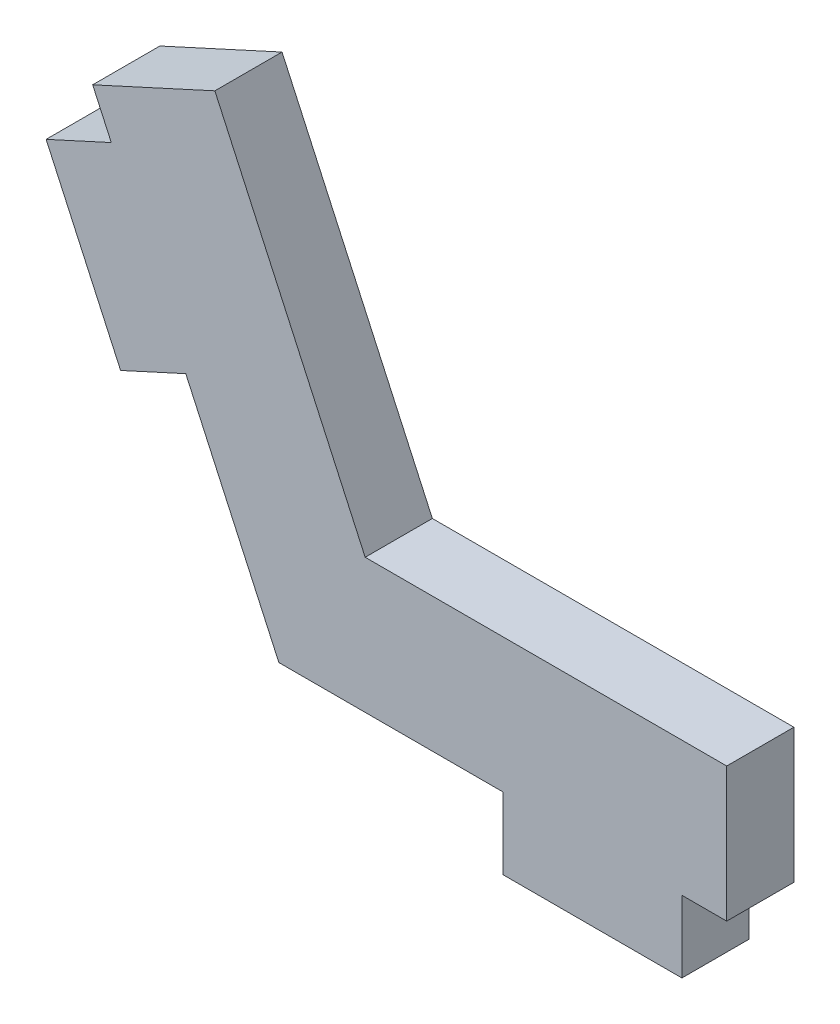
ISO-10303-21;
HEADER;
FILE_DESCRIPTION(('STEP AP214'),'2;1');
FILE_NAME('part.step','',(''),(''),'','','');
FILE_SCHEMA(('AUTOMOTIVE_DESIGN { 1 0 10303 214 1 1 1 1 }'));
ENDSEC;
DATA;
#1=APPLICATION_CONTEXT('core data for automotive mechanical design processes');
#2=APPLICATION_PROTOCOL_DEFINITION('international standard','automotive_design',2000,#1);
#3=PRODUCT_CONTEXT('',#1,'mechanical');
#4=PRODUCT('Part','Part','',(#3));
#5=PRODUCT_RELATED_PRODUCT_CATEGORY('part','',(#4));
#6=PRODUCT_DEFINITION_FORMATION('','',#4);
#7=PRODUCT_DEFINITION_CONTEXT('part definition',#1,'design');
#8=PRODUCT_DEFINITION('design','',#6,#7);
#9=PRODUCT_DEFINITION_SHAPE('','',#8);
#10=(LENGTH_UNIT() NAMED_UNIT(*) SI_UNIT(.MILLI.,.METRE.));
#11=(NAMED_UNIT(*) PLANE_ANGLE_UNIT() SI_UNIT($,.RADIAN.));
#12=(NAMED_UNIT(*) SI_UNIT($,.STERADIAN.) SOLID_ANGLE_UNIT());
#13=UNCERTAINTY_MEASURE_WITH_UNIT(LENGTH_MEASURE(1.E-05),#10,'distance_accuracy_value','');
#14=(GEOMETRIC_REPRESENTATION_CONTEXT(3) GLOBAL_UNCERTAINTY_ASSIGNED_CONTEXT((#13)) GLOBAL_UNIT_ASSIGNED_CONTEXT((#10,
#11,#12)) REPRESENTATION_CONTEXT('',''));
#15=CARTESIAN_POINT('',(0.,0.,0.));
#16=DIRECTION('',(0.,0.,1.));
#17=DIRECTION('',(1.,0.,0.));
#18=AXIS2_PLACEMENT_3D('',#15,#16,#17);
#19=CARTESIAN_POINT('',(0.,0.,3.));
#20=DIRECTION('',(0.,1.,0.));
#21=DIRECTION('',(0.,0.,1.));
#22=AXIS2_PLACEMENT_3D('',#19,#20,#21);
#23=PLANE('',#22);
#24=DIRECTION('',(0.,0.,-1.));
#25=VECTOR('',#24,1.);
#26=CARTESIAN_POINT('',(10.,0.,3.));
#27=LINE('',#26,#25);
#28=CARTESIAN_POINT('',(10.,0.,3.));
#29=VERTEX_POINT('',#28);
#30=CARTESIAN_POINT('',(10.,0.,0.));
#31=VERTEX_POINT('',#30);
#32=EDGE_CURVE('E142',#29,#31,#27,.T.);
#33=ORIENTED_EDGE('',*,*,#32,.F.);
#34=DIRECTION('',(1.,0.,0.));
#35=VECTOR('',#34,1.);
#36=CARTESIAN_POINT('',(0.,0.,3.));
#37=LINE('',#36,#35);
#38=CARTESIAN_POINT('',(0.,0.,3.));
#39=VERTEX_POINT('',#38);
#40=EDGE_CURVE('E159',#39,#29,#37,.T.);
#41=ORIENTED_EDGE('',*,*,#40,.F.);
#42=DIRECTION('',(0.,0.,-1.));
#43=VECTOR('',#42,1.);
#44=CARTESIAN_POINT('',(0.,0.,3.));
#45=LINE('',#44,#43);
#46=CARTESIAN_POINT('',(0.,0.,0.));
#47=VERTEX_POINT('',#46);
#48=EDGE_CURVE('E191',#39,#47,#45,.T.);
#49=ORIENTED_EDGE('',*,*,#48,.T.);
#50=DIRECTION('',(1.,0.,0.));
#51=VECTOR('',#50,1.);
#52=CARTESIAN_POINT('',(0.,0.,0.));
#53=LINE('',#52,#51);
#54=EDGE_CURVE('E186',#47,#31,#53,.T.);
#55=ORIENTED_EDGE('',*,*,#54,.T.);
#56=EDGE_LOOP('',(#33,#41,#49,#55));
#57=FACE_BOUND('',#56,.T.);
#58=ADVANCED_FACE('F37',(#57),#23,.F.);
#59=CARTESIAN_POINT('',(0.,0.,3.));
#60=DIRECTION('',(-0.909453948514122,-0.415804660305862,0.));
#61=DIRECTION('',(0.415804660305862,-0.909453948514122,0.));
#62=AXIS2_PLACEMENT_3D('',#59,#60,#61);
#63=PLANE('',#62);
#64=DIRECTION('',(-0.415804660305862,0.909453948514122,0.));
#65=VECTOR('',#64,1.);
#66=CARTESIAN_POINT('',(0.,0.,0.));
#67=LINE('',#66,#65);
#68=CARTESIAN_POINT('',(-7.48448388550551,16.3701710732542,0.));
#69=VERTEX_POINT('',#68);
#70=CARTESIAN_POINT('',(-8.31609320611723,18.1890789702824,0.));
#71=VERTEX_POINT('',#70);
#72=EDGE_CURVE('E181',#69,#71,#67,.T.);
#73=ORIENTED_EDGE('',*,*,#72,.F.);
#74=DIRECTION('',(0.,0.,-1.));
#75=VECTOR('',#74,1.);
#76=CARTESIAN_POINT('',(-7.48448388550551,16.3701710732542,3.));
#77=LINE('',#76,#75);
#78=CARTESIAN_POINT('',(-7.48448388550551,16.3701710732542,3.));
#79=VERTEX_POINT('',#78);
#80=EDGE_CURVE('E231',#79,#69,#77,.T.);
#81=ORIENTED_EDGE('',*,*,#80,.F.);
#82=DIRECTION('',(-0.415804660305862,0.909453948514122,0.));
#83=VECTOR('',#82,1.);
#84=CARTESIAN_POINT('',(0.,0.,3.));
#85=LINE('',#84,#83);
#86=CARTESIAN_POINT('',(-8.31609320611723,18.1890789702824,3.));
#87=VERTEX_POINT('',#86);
#88=EDGE_CURVE('E164',#79,#87,#85,.T.);
#89=ORIENTED_EDGE('',*,*,#88,.T.);
#90=DIRECTION('',(0.,0.,-1.));
#91=VECTOR('',#90,1.);
#92=CARTESIAN_POINT('',(-8.31609320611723,18.1890789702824,3.));
#93=LINE('',#92,#91);
#94=EDGE_CURVE('E193',#87,#71,#93,.T.);
#95=ORIENTED_EDGE('',*,*,#94,.T.);
#96=EDGE_LOOP('',(#73,#81,#89,#95));
#97=FACE_BOUND('',#96,.T.);
#98=ADVANCED_FACE('F272',(#97),#63,.T.);
#99=CARTESIAN_POINT('',(20.,0.,3.));
#100=DIRECTION('',(1.,0.,0.));
#101=DIRECTION('',(0.,0.,-1.));
#102=AXIS2_PLACEMENT_3D('',#99,#100,#101);
#103=PLANE('',#102);
#104=DIRECTION('',(0.,-1.,0.));
#105=VECTOR('',#104,1.);
#106=CARTESIAN_POINT('',(20.,0.,0.));
#107=LINE('',#106,#105);
#108=CARTESIAN_POINT('',(20.,6.,0.));
#109=VERTEX_POINT('',#108);
#110=CARTESIAN_POINT('',(20.,0.,0.));
#111=VERTEX_POINT('',#110);
#112=EDGE_CURVE('E168',#109,#111,#107,.T.);
#113=ORIENTED_EDGE('',*,*,#112,.F.);
#114=DIRECTION('',(0.,0.,-1.));
#115=VECTOR('',#114,1.);
#116=CARTESIAN_POINT('',(20.,6.,3.));
#117=LINE('',#116,#115);
#118=CARTESIAN_POINT('',(20.,6.,3.));
#119=VERTEX_POINT('',#118);
#120=EDGE_CURVE('E11',#119,#109,#117,.T.);
#121=ORIENTED_EDGE('',*,*,#120,.F.);
#122=DIRECTION('',(0.,-1.,0.));
#123=VECTOR('',#122,1.);
#124=CARTESIAN_POINT('',(20.,0.,3.));
#125=LINE('',#124,#123);
#126=CARTESIAN_POINT('',(20.,0.,3.));
#127=VERTEX_POINT('',#126);
#128=EDGE_CURVE('E189',#119,#127,#125,.T.);
#129=ORIENTED_EDGE('',*,*,#128,.T.);
#130=DIRECTION('',(0.,0.,-1.));
#131=VECTOR('',#130,1.);
#132=CARTESIAN_POINT('',(20.,0.,3.));
#133=LINE('',#132,#131);
#134=EDGE_CURVE('E157',#127,#111,#133,.T.);
#135=ORIENTED_EDGE('',*,*,#134,.T.);
#136=EDGE_LOOP('',(#113,#121,#129,#135));
#137=FACE_BOUND('',#136,.T.);
#138=ADVANCED_FACE('F39',(#137),#103,.T.);
#139=CARTESIAN_POINT('',(0.,6.,3.));
#140=DIRECTION('',(0.,1.,0.));
#141=DIRECTION('',(0.,0.,1.));
#142=AXIS2_PLACEMENT_3D('',#139,#140,#141);
#143=PLANE('',#142);
#144=DIRECTION('',(1.,0.,0.));
#145=VECTOR('',#144,1.);
#146=CARTESIAN_POINT('',(0.,6.,0.));
#147=LINE('',#146,#145);
#148=CARTESIAN_POINT('',(3.85415011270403,6.,0.));
#149=VERTEX_POINT('',#148);
#150=EDGE_CURVE('E171',#149,#109,#147,.T.);
#151=ORIENTED_EDGE('',*,*,#150,.F.);
#152=DIRECTION('',(0.,0.,-1.));
#153=VECTOR('',#152,1.);
#154=CARTESIAN_POINT('',(3.85415011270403,6.,3.));
#155=LINE('',#154,#153);
#156=CARTESIAN_POINT('',(3.85415011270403,6.,3.));
#157=VERTEX_POINT('',#156);
#158=EDGE_CURVE('E45',#157,#149,#155,.T.);
#159=ORIENTED_EDGE('',*,*,#158,.F.);
#160=DIRECTION('',(1.,0.,0.));
#161=VECTOR('',#160,1.);
#162=CARTESIAN_POINT('',(0.,6.,3.));
#163=LINE('',#162,#161);
#164=EDGE_CURVE('E219',#157,#119,#163,.T.);
#165=ORIENTED_EDGE('',*,*,#164,.T.);
#166=ORIENTED_EDGE('',*,*,#120,.T.);
#167=EDGE_LOOP('',(#151,#159,#165,#166));
#168=FACE_BOUND('',#167,.T.);
#169=ADVANCED_FACE('F207',(#168),#143,.T.);
#170=CARTESIAN_POINT('',(5.45672369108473,2.49482796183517,3.));
#171=DIRECTION('',(0.909453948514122,0.415804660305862,0.));
#172=DIRECTION('',(-0.415804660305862,0.909453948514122,0.));
#173=AXIS2_PLACEMENT_3D('',#170,#171,#172);
#174=PLANE('',#173);
#175=DIRECTION('',(0.415804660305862,-0.909453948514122,0.));
#176=VECTOR('',#175,1.);
#177=CARTESIAN_POINT('',(5.45672369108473,2.49482796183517,0.));
#178=LINE('',#177,#176);
#179=CARTESIAN_POINT('',(-2.8593695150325,20.6839069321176,0.));
#180=VERTEX_POINT('',#179);
#181=EDGE_CURVE('E175',#180,#149,#178,.T.);
#182=ORIENTED_EDGE('',*,*,#181,.F.);
#183=DIRECTION('',(0.,0.,-1.));
#184=VECTOR('',#183,1.);
#185=CARTESIAN_POINT('',(-2.8593695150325,20.6839069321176,3.));
#186=LINE('',#185,#184);
#187=CARTESIAN_POINT('',(-2.8593695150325,20.6839069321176,3.));
#188=VERTEX_POINT('',#187);
#189=EDGE_CURVE('E196',#188,#180,#186,.T.);
#190=ORIENTED_EDGE('',*,*,#189,.F.);
#191=DIRECTION('',(0.415804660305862,-0.909453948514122,0.));
#192=VECTOR('',#191,1.);
#193=CARTESIAN_POINT('',(5.45672369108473,2.49482796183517,3.));
#194=LINE('',#193,#192);
#195=EDGE_CURVE('E203',#188,#157,#194,.T.);
#196=ORIENTED_EDGE('',*,*,#195,.T.);
#197=ORIENTED_EDGE('',*,*,#158,.T.);
#198=EDGE_LOOP('',(#182,#190,#196,#197));
#199=FACE_BOUND('',#198,.T.);
#200=ADVANCED_FACE('F201',(#199),#174,.T.);
#201=CARTESIAN_POINT('',(-8.31609320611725,18.1890789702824,3.));
#202=DIRECTION('',(-0.415804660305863,0.909453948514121,0.));
#203=DIRECTION('',(-0.909453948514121,-0.415804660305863,0.));
#204=AXIS2_PLACEMENT_3D('',#201,#202,#203);
#205=PLANE('',#204);
#206=DIRECTION('',(0.909453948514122,0.415804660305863,0.));
#207=VECTOR('',#206,1.);
#208=CARTESIAN_POINT('',(-8.31609320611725,18.1890789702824,0.));
#209=LINE('',#208,#207);
#210=EDGE_CURVE('E178',#71,#180,#209,.T.);
#211=ORIENTED_EDGE('',*,*,#210,.F.);
#212=ORIENTED_EDGE('',*,*,#94,.F.);
#213=DIRECTION('',(0.909453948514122,0.415804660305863,0.));
#214=VECTOR('',#213,1.);
#215=CARTESIAN_POINT('',(-8.31609320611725,18.1890789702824,3.));
#216=LINE('',#215,#214);
#217=EDGE_CURVE('E217',#87,#188,#216,.T.);
#218=ORIENTED_EDGE('',*,*,#217,.T.);
#219=ORIENTED_EDGE('',*,*,#189,.T.);
#220=EDGE_LOOP('',(#211,#212,#218,#219));
#221=FACE_BOUND('',#220,.T.);
#222=ADVANCED_FACE('F214',(#221),#205,.T.);
#223=DIRECTION('',(0.,0.,-1.));
#224=VECTOR('',#223,1.);
#225=CARTESIAN_POINT('',(-4.15804660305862,9.09453948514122,3.));
#226=LINE('',#225,#224);
#227=CARTESIAN_POINT('',(-4.15804660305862,9.09453948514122,3.));
#228=VERTEX_POINT('',#227);
#229=CARTESIAN_POINT('',(-4.15804660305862,9.09453948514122,0.));
#230=VERTEX_POINT('',#229);
#231=EDGE_CURVE('E228',#228,#230,#226,.T.);
#232=ORIENTED_EDGE('',*,*,#231,.T.);
#233=EDGE_CURVE('E182',#47,#230,#67,.T.);
#234=ORIENTED_EDGE('',*,*,#233,.F.);
#235=ORIENTED_EDGE('',*,*,#48,.F.);
#236=EDGE_CURVE('E160',#39,#228,#85,.T.);
#237=ORIENTED_EDGE('',*,*,#236,.T.);
#238=EDGE_LOOP('',(#232,#234,#235,#237));
#239=FACE_BOUND('',#238,.T.);
#240=ADVANCED_FACE('F279',(#239),#63,.T.);
#241=CARTESIAN_POINT('',(18.,0.,3.));
#242=VERTEX_POINT('',#241);
#243=EDGE_CURVE('E147',#242,#127,#37,.T.);
#244=ORIENTED_EDGE('',*,*,#243,.F.);
#245=DIRECTION('',(0.,0.,-1.));
#246=VECTOR('',#245,1.);
#247=CARTESIAN_POINT('',(18.,0.,3.));
#248=LINE('',#247,#246);
#249=CARTESIAN_POINT('',(18.,0.,0.));
#250=VERTEX_POINT('',#249);
#251=EDGE_CURVE('E135',#242,#250,#248,.T.);
#252=ORIENTED_EDGE('',*,*,#251,.T.);
#253=EDGE_CURVE('E185',#250,#111,#53,.T.);
#254=ORIENTED_EDGE('',*,*,#253,.T.);
#255=ORIENTED_EDGE('',*,*,#134,.F.);
#256=EDGE_LOOP('',(#244,#252,#254,#255));
#257=FACE_BOUND('',#256,.T.);
#258=ADVANCED_FACE('F155',(#257),#23,.F.);
#259=CARTESIAN_POINT('',(0.,0.,3.));
#260=DIRECTION('',(0.,0.,1.));
#261=DIRECTION('',(1.,0.,0.));
#262=AXIS2_PLACEMENT_3D('',#259,#260,#261);
#263=PLANE('',#262);
#264=ORIENTED_EDGE('',*,*,#128,.F.);
#265=ORIENTED_EDGE('',*,*,#164,.F.);
#266=ORIENTED_EDGE('',*,*,#195,.F.);
#267=ORIENTED_EDGE('',*,*,#217,.F.);
#268=ORIENTED_EDGE('',*,*,#88,.F.);
#269=DIRECTION('',(-0.909453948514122,-0.415804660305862,0.));
#270=VECTOR('',#269,1.);
#271=CARTESIAN_POINT('',(-7.48448388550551,16.3701710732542,3.));
#272=LINE('',#271,#270);
#273=CARTESIAN_POINT('',(-10.3947365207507,15.0395961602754,3.));
#274=VERTEX_POINT('',#273);
#275=EDGE_CURVE('E237',#79,#274,#272,.T.);
#276=ORIENTED_EDGE('',*,*,#275,.T.);
#277=DIRECTION('',(0.415804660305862,-0.909453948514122,0.));
#278=VECTOR('',#277,1.);
#279=CARTESIAN_POINT('',(-2.91025263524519,-1.33057491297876,3.));
#280=LINE('',#279,#278);
#281=CARTESIAN_POINT('',(-7.06829923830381,7.76396457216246,3.));
#282=VERTEX_POINT('',#281);
#283=EDGE_CURVE('E244',#274,#282,#280,.T.);
#284=ORIENTED_EDGE('',*,*,#283,.T.);
#285=DIRECTION('',(-0.909453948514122,-0.415804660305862,0.));
#286=VECTOR('',#285,1.);
#287=CARTESIAN_POINT('',(-4.15804660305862,9.09453948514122,3.));
#288=LINE('',#287,#286);
#289=EDGE_CURVE('E233',#228,#282,#288,.T.);
#290=ORIENTED_EDGE('',*,*,#289,.F.);
#291=ORIENTED_EDGE('',*,*,#236,.F.);
#292=ORIENTED_EDGE('',*,*,#40,.T.);
#293=DIRECTION('',(0.,-1.,0.));
#294=VECTOR('',#293,1.);
#295=CARTESIAN_POINT('',(10.,0.,3.));
#296=LINE('',#295,#294);
#297=CARTESIAN_POINT('',(10.,-3.2,3.));
#298=VERTEX_POINT('',#297);
#299=EDGE_CURVE('E152',#29,#298,#296,.T.);
#300=ORIENTED_EDGE('',*,*,#299,.T.);
#301=DIRECTION('',(1.,0.,0.));
#302=VECTOR('',#301,1.);
#303=CARTESIAN_POINT('',(0.,-3.2,3.));
#304=LINE('',#303,#302);
#305=CARTESIAN_POINT('',(18.,-3.2,3.));
#306=VERTEX_POINT('',#305);
#307=EDGE_CURVE('E150',#298,#306,#304,.T.);
#308=ORIENTED_EDGE('',*,*,#307,.T.);
#309=DIRECTION('',(0.,-1.,0.));
#310=VECTOR('',#309,1.);
#311=CARTESIAN_POINT('',(18.,0.,3.));
#312=LINE('',#311,#310);
#313=EDGE_CURVE('E138',#242,#306,#312,.T.);
#314=ORIENTED_EDGE('',*,*,#313,.F.);
#315=ORIENTED_EDGE('',*,*,#243,.T.);
#316=EDGE_LOOP('',(#264,#265,#266,#267,#268,#276,#284,#290,#291,#292,#300,#308,#314,#315));
#317=FACE_BOUND('',#316,.T.);
#318=ADVANCED_FACE('F146',(#317),#263,.T.);
#319=CARTESIAN_POINT('',(0.,0.,0.));
#320=DIRECTION('',(0.,0.,1.));
#321=DIRECTION('',(1.,0.,0.));
#322=AXIS2_PLACEMENT_3D('',#319,#320,#321);
#323=PLANE('',#322);
#324=ORIENTED_EDGE('',*,*,#112,.T.);
#325=ORIENTED_EDGE('',*,*,#253,.F.);
#326=DIRECTION('',(0.,-1.,0.));
#327=VECTOR('',#326,1.);
#328=CARTESIAN_POINT('',(18.,0.,0.));
#329=LINE('',#328,#327);
#330=CARTESIAN_POINT('',(18.,-3.2,0.));
#331=VERTEX_POINT('',#330);
#332=EDGE_CURVE('E52',#250,#331,#329,.T.);
#333=ORIENTED_EDGE('',*,*,#332,.T.);
#334=DIRECTION('',(1.,0.,0.));
#335=VECTOR('',#334,1.);
#336=CARTESIAN_POINT('',(0.,-3.2,0.));
#337=LINE('',#336,#335);
#338=CARTESIAN_POINT('',(10.,-3.2,0.));
#339=VERTEX_POINT('',#338);
#340=EDGE_CURVE('E153',#339,#331,#337,.T.);
#341=ORIENTED_EDGE('',*,*,#340,.F.);
#342=DIRECTION('',(0.,-1.,0.));
#343=VECTOR('',#342,1.);
#344=CARTESIAN_POINT('',(10.,0.,0.));
#345=LINE('',#344,#343);
#346=EDGE_CURVE('E256',#31,#339,#345,.T.);
#347=ORIENTED_EDGE('',*,*,#346,.F.);
#348=ORIENTED_EDGE('',*,*,#54,.F.);
#349=ORIENTED_EDGE('',*,*,#233,.T.);
#350=DIRECTION('',(-0.909453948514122,-0.415804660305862,0.));
#351=VECTOR('',#350,1.);
#352=CARTESIAN_POINT('',(-4.15804660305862,9.09453948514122,0.));
#353=LINE('',#352,#351);
#354=CARTESIAN_POINT('',(-7.06829923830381,7.76396457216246,0.));
#355=VERTEX_POINT('',#354);
#356=EDGE_CURVE('E234',#230,#355,#353,.T.);
#357=ORIENTED_EDGE('',*,*,#356,.T.);
#358=DIRECTION('',(0.415804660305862,-0.909453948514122,0.));
#359=VECTOR('',#358,1.);
#360=CARTESIAN_POINT('',(-2.91025263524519,-1.33057491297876,0.));
#361=LINE('',#360,#359);
#362=CARTESIAN_POINT('',(-10.3947365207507,15.0395961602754,0.));
#363=VERTEX_POINT('',#362);
#364=EDGE_CURVE('E238',#363,#355,#361,.T.);
#365=ORIENTED_EDGE('',*,*,#364,.F.);
#366=DIRECTION('',(-0.909453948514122,-0.415804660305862,0.));
#367=VECTOR('',#366,1.);
#368=CARTESIAN_POINT('',(-7.48448388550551,16.3701710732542,0.));
#369=LINE('',#368,#367);
#370=EDGE_CURVE('E60',#69,#363,#369,.T.);
#371=ORIENTED_EDGE('',*,*,#370,.F.);
#372=ORIENTED_EDGE('',*,*,#72,.T.);
#373=ORIENTED_EDGE('',*,*,#210,.T.);
#374=ORIENTED_EDGE('',*,*,#181,.T.);
#375=ORIENTED_EDGE('',*,*,#150,.T.);
#376=EDGE_LOOP('',(#324,#325,#333,#341,#347,#348,#349,#357,#365,#371,#372,#373,#374,#375));
#377=FACE_BOUND('',#376,.T.);
#378=ADVANCED_FACE('F209',(#377),#323,.F.);
#379=CARTESIAN_POINT('',(-7.48448388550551,16.3701710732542,3.));
#380=DIRECTION('',(0.415804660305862,-0.909453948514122,0.));
#381=DIRECTION('',(0.909453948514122,0.415804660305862,0.));
#382=AXIS2_PLACEMENT_3D('',#379,#380,#381);
#383=PLANE('',#382);
#384=ORIENTED_EDGE('',*,*,#370,.T.);
#385=DIRECTION('',(0.,0.,-1.));
#386=VECTOR('',#385,1.);
#387=CARTESIAN_POINT('',(-10.3947365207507,15.0395961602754,3.));
#388=LINE('',#387,#386);
#389=EDGE_CURVE('E172',#274,#363,#388,.T.);
#390=ORIENTED_EDGE('',*,*,#389,.F.);
#391=ORIENTED_EDGE('',*,*,#275,.F.);
#392=ORIENTED_EDGE('',*,*,#80,.T.);
#393=EDGE_LOOP('',(#384,#390,#391,#392));
#394=FACE_BOUND('',#393,.T.);
#395=ADVANCED_FACE('F347',(#394),#383,.F.);
#396=CARTESIAN_POINT('',(-2.91025263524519,-1.33057491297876,3.));
#397=DIRECTION('',(0.909453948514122,0.415804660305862,0.));
#398=DIRECTION('',(-0.415804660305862,0.909453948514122,0.));
#399=AXIS2_PLACEMENT_3D('',#396,#397,#398);
#400=PLANE('',#399);
#401=ORIENTED_EDGE('',*,*,#364,.T.);
#402=DIRECTION('',(0.,0.,-1.));
#403=VECTOR('',#402,1.);
#404=CARTESIAN_POINT('',(-7.06829923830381,7.76396457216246,3.));
#405=LINE('',#404,#403);
#406=EDGE_CURVE('E226',#282,#355,#405,.T.);
#407=ORIENTED_EDGE('',*,*,#406,.F.);
#408=ORIENTED_EDGE('',*,*,#283,.F.);
#409=ORIENTED_EDGE('',*,*,#389,.T.);
#410=EDGE_LOOP('',(#401,#407,#408,#409));
#411=FACE_BOUND('',#410,.T.);
#412=ADVANCED_FACE('F355',(#411),#400,.F.);
#413=CARTESIAN_POINT('',(-4.15804660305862,9.09453948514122,3.));
#414=DIRECTION('',(0.415804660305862,-0.909453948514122,0.));
#415=DIRECTION('',(0.909453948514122,0.415804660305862,0.));
#416=AXIS2_PLACEMENT_3D('',#413,#414,#415);
#417=PLANE('',#416);
#418=ORIENTED_EDGE('',*,*,#356,.F.);
#419=ORIENTED_EDGE('',*,*,#231,.F.);
#420=ORIENTED_EDGE('',*,*,#289,.T.);
#421=ORIENTED_EDGE('',*,*,#406,.T.);
#422=EDGE_LOOP('',(#418,#419,#420,#421));
#423=FACE_BOUND('',#422,.T.);
#424=ADVANCED_FACE('F365',(#423),#417,.T.);
#425=CARTESIAN_POINT('',(18.,0.,3.));
#426=DIRECTION('',(1.,0.,0.));
#427=DIRECTION('',(0.,0.,-1.));
#428=AXIS2_PLACEMENT_3D('',#425,#426,#427);
#429=PLANE('',#428);
#430=ORIENTED_EDGE('',*,*,#332,.F.);
#431=ORIENTED_EDGE('',*,*,#251,.F.);
#432=ORIENTED_EDGE('',*,*,#313,.T.);
#433=DIRECTION('',(0.,0.,-1.));
#434=VECTOR('',#433,1.);
#435=CARTESIAN_POINT('',(18.,-3.2,3.));
#436=LINE('',#435,#434);
#437=EDGE_CURVE('E252',#306,#331,#436,.T.);
#438=ORIENTED_EDGE('',*,*,#437,.T.);
#439=EDGE_LOOP('',(#430,#431,#432,#438));
#440=FACE_BOUND('',#439,.T.);
#441=ADVANCED_FACE('F137',(#440),#429,.T.);
#442=CARTESIAN_POINT('',(10.,0.,3.));
#443=DIRECTION('',(1.,0.,0.));
#444=DIRECTION('',(0.,0.,-1.));
#445=AXIS2_PLACEMENT_3D('',#442,#443,#444);
#446=PLANE('',#445);
#447=ORIENTED_EDGE('',*,*,#346,.T.);
#448=DIRECTION('',(0.,0.,-1.));
#449=VECTOR('',#448,1.);
#450=CARTESIAN_POINT('',(10.,-3.2,3.));
#451=LINE('',#450,#449);
#452=EDGE_CURVE('E249',#298,#339,#451,.T.);
#453=ORIENTED_EDGE('',*,*,#452,.F.);
#454=ORIENTED_EDGE('',*,*,#299,.F.);
#455=ORIENTED_EDGE('',*,*,#32,.T.);
#456=EDGE_LOOP('',(#447,#453,#454,#455));
#457=FACE_BOUND('',#456,.T.);
#458=ADVANCED_FACE('F265',(#457),#446,.F.);
#459=CARTESIAN_POINT('',(0.,-3.2,3.));
#460=DIRECTION('',(0.,1.,0.));
#461=DIRECTION('',(0.,0.,1.));
#462=AXIS2_PLACEMENT_3D('',#459,#460,#461);
#463=PLANE('',#462);
#464=ORIENTED_EDGE('',*,*,#340,.T.);
#465=ORIENTED_EDGE('',*,*,#437,.F.);
#466=ORIENTED_EDGE('',*,*,#307,.F.);
#467=ORIENTED_EDGE('',*,*,#452,.T.);
#468=EDGE_LOOP('',(#464,#465,#466,#467));
#469=FACE_BOUND('',#468,.T.);
#470=ADVANCED_FACE('F269',(#469),#463,.F.);
#471=CLOSED_SHELL('',(#58,#98,#138,#169,#200,#222,#240,#258,#318,#378,#395,#412,#424,#441,#458,#470));
#472=MANIFOLD_SOLID_BREP('B2',#471);
#473=ADVANCED_BREP_SHAPE_REPRESENTATION('',(#18,#472),#14);
#474=SHAPE_DEFINITION_REPRESENTATION(#9,#473);
ENDSEC;
END-ISO-10303-21;
